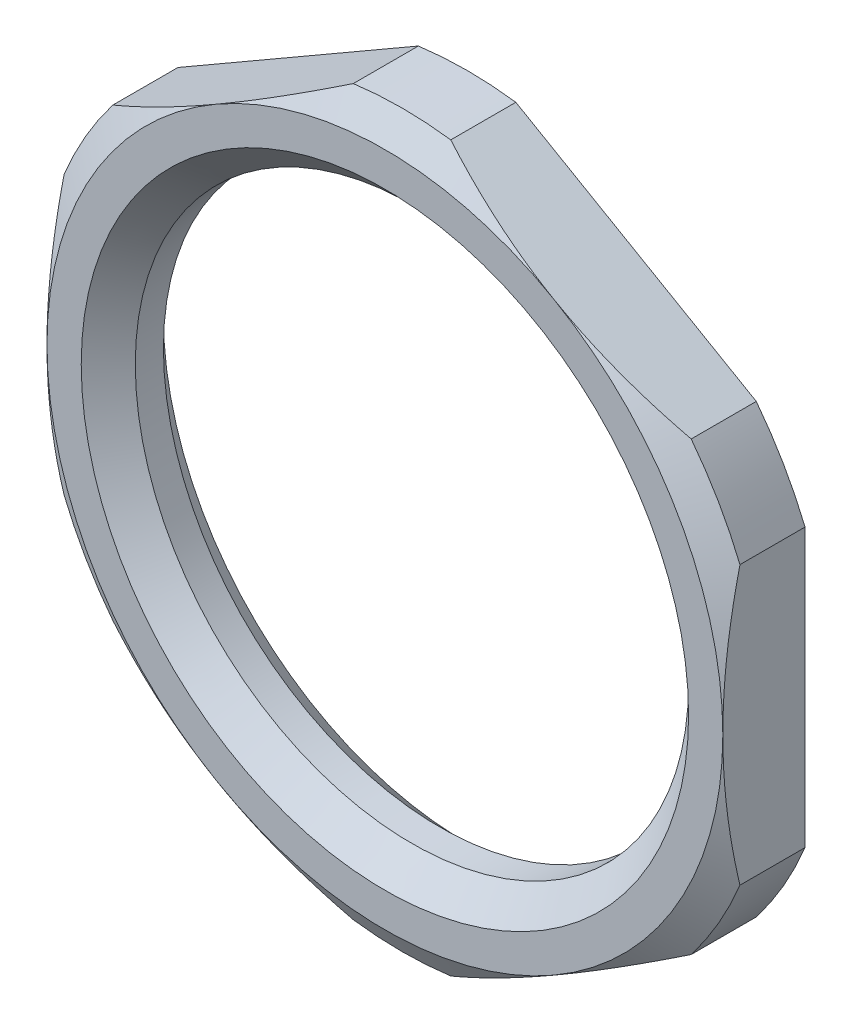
ISO-10303-21;
HEADER;
FILE_DESCRIPTION(('STEP AP214'),'2;1');
FILE_NAME('part.step','',(''),(''),'','','');
FILE_SCHEMA(('AUTOMOTIVE_DESIGN { 1 0 10303 214 1 1 1 1 }'));
ENDSEC;
DATA;
#1=APPLICATION_CONTEXT('core data for automotive mechanical design processes');
#2=APPLICATION_PROTOCOL_DEFINITION('international standard','automotive_design',2000,#1);
#3=PRODUCT_CONTEXT('',#1,'mechanical');
#4=PRODUCT('Part','Part','',(#3));
#5=PRODUCT_RELATED_PRODUCT_CATEGORY('part','',(#4));
#6=PRODUCT_DEFINITION_FORMATION('','',#4);
#7=PRODUCT_DEFINITION_CONTEXT('part definition',#1,'design');
#8=PRODUCT_DEFINITION('design','',#6,#7);
#9=PRODUCT_DEFINITION_SHAPE('','',#8);
#10=(LENGTH_UNIT() NAMED_UNIT(*) SI_UNIT(.MILLI.,.METRE.));
#11=(NAMED_UNIT(*) PLANE_ANGLE_UNIT() SI_UNIT($,.RADIAN.));
#12=(NAMED_UNIT(*) SI_UNIT($,.STERADIAN.) SOLID_ANGLE_UNIT());
#13=UNCERTAINTY_MEASURE_WITH_UNIT(LENGTH_MEASURE(1.E-05),#10,'distance_accuracy_value','');
#14=(GEOMETRIC_REPRESENTATION_CONTEXT(3) GLOBAL_UNCERTAINTY_ASSIGNED_CONTEXT((#13)) GLOBAL_UNIT_ASSIGNED_CONTEXT((#10,
#11,#12)) REPRESENTATION_CONTEXT('',''));
#15=CARTESIAN_POINT('',(0.,0.,0.));
#16=DIRECTION('',(0.,0.,1.));
#17=DIRECTION('',(1.,0.,0.));
#18=AXIS2_PLACEMENT_3D('',#15,#16,#17);
#19=CARTESIAN_POINT('',(0.,16.625,0.));
#20=DIRECTION('',(0.,0.,-1.));
#21=DIRECTION('',(-1.,0.,0.));
#22=AXIS2_PLACEMENT_3D('',#19,#20,#21);
#23=PLANE('',#22);
#24=DIRECTION('',(-0.866025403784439,-0.5,0.));
#25=VECTOR('',#24,1.);
#26=CARTESIAN_POINT('',(-2.05116383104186,20.1777199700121,0.));
#27=LINE('',#26,#25);
#28=CARTESIAN_POINT('',(-2.66877670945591,19.8211410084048,0.));
#29=VERTEX_POINT('',#28);
#30=CARTESIAN_POINT('',(-15.8312232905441,12.2217989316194,0.));
#31=VERTEX_POINT('',#30);
#32=EDGE_CURVE('E389',#29,#31,#27,.T.);
#33=ORIENTED_EDGE('',*,*,#32,.F.);
#34=CARTESIAN_POINT('',(0.,0.,0.));
#35=DIRECTION('',(0.,0.,-1.));
#36=DIRECTION('',(-1.,0.,0.));
#37=AXIS2_PLACEMENT_3D('',#34,#35,#36);
#38=CIRCLE('',#37,20.);
#39=CARTESIAN_POINT('',(2.6687767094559,19.8211410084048,0.));
#40=VERTEX_POINT('',#39);
#41=EDGE_CURVE('E391',#40,#29,#38,.F.);
#42=ORIENTED_EDGE('',*,*,#41,.F.);
#43=DIRECTION('',(-0.866025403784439,0.5,0.));
#44=VECTOR('',#43,1.);
#45=CARTESIAN_POINT('',(2.05116383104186,20.1777199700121,0.));
#46=LINE('',#45,#44);
#47=CARTESIAN_POINT('',(15.8312232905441,12.2217989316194,0.));
#48=VERTEX_POINT('',#47);
#49=EDGE_CURVE('E147',#48,#40,#46,.T.);
#50=ORIENTED_EDGE('',*,*,#49,.F.);
#51=CARTESIAN_POINT('',(2.18575157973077E-13,1.31838984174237E-13,0.));
#52=DIRECTION('',(0.,0.,-1.));
#53=DIRECTION('',(-1.,0.,0.));
#54=AXIS2_PLACEMENT_3D('',#51,#52,#53);
#55=CIRCLE('',#54,19.9999999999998);
#56=CARTESIAN_POINT('',(18.5,7.59934207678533,0.));
#57=VERTEX_POINT('',#56);
#58=EDGE_CURVE('E140',#57,#48,#55,.F.);
#59=ORIENTED_EDGE('',*,*,#58,.F.);
#60=DIRECTION('',(0.,1.,0.));
#61=VECTOR('',#60,1.);
#62=CARTESIAN_POINT('',(18.5,16.625,0.));
#63=LINE('',#62,#61);
#64=CARTESIAN_POINT('',(18.5,-7.59934207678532,0.));
#65=VERTEX_POINT('',#64);
#66=EDGE_CURVE('E130',#65,#57,#63,.T.);
#67=ORIENTED_EDGE('',*,*,#66,.F.);
#68=CARTESIAN_POINT('',(1.49186218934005E-13,0.,0.));
#69=DIRECTION('',(0.,0.,-1.));
#70=DIRECTION('',(-1.,0.,0.));
#71=AXIS2_PLACEMENT_3D('',#68,#69,#70);
#72=CIRCLE('',#71,20.);
#73=CARTESIAN_POINT('',(15.8312232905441,-12.2217989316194,0.));
#74=VERTEX_POINT('',#73);
#75=EDGE_CURVE('E119',#74,#65,#72,.F.);
#76=ORIENTED_EDGE('',*,*,#75,.F.);
#77=DIRECTION('',(0.866025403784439,0.5,0.));
#78=VECTOR('',#77,1.);
#79=CARTESIAN_POINT('',(16.4488361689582,-11.8652199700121,0.));
#80=LINE('',#79,#78);
#81=CARTESIAN_POINT('',(2.66877670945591,-19.8211410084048,0.));
#82=VERTEX_POINT('',#81);
#83=EDGE_CURVE('E124',#82,#74,#80,.T.);
#84=ORIENTED_EDGE('',*,*,#83,.F.);
#85=CARTESIAN_POINT('',(0.,0.,0.));
#86=DIRECTION('',(0.,0.,-1.));
#87=DIRECTION('',(-1.,0.,0.));
#88=AXIS2_PLACEMENT_3D('',#85,#86,#87);
#89=CIRCLE('',#88,20.);
#90=CARTESIAN_POINT('',(-2.6687767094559,-19.8211410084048,0.));
#91=VERTEX_POINT('',#90);
#92=EDGE_CURVE('E379',#91,#82,#89,.F.);
#93=ORIENTED_EDGE('',*,*,#92,.F.);
#94=DIRECTION('',(0.866025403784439,-0.5,0.));
#95=VECTOR('',#94,1.);
#96=CARTESIAN_POINT('',(-16.4488361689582,-11.8652199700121,0.));
#97=LINE('',#96,#95);
#98=CARTESIAN_POINT('',(-15.8312232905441,-12.2217989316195,0.));
#99=VERTEX_POINT('',#98);
#100=EDGE_CURVE('E381',#99,#91,#97,.T.);
#101=ORIENTED_EDGE('',*,*,#100,.F.);
#102=CARTESIAN_POINT('',(-1.56125112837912E-13,0.,0.));
#103=DIRECTION('',(0.,0.,-1.));
#104=DIRECTION('',(-1.,0.,0.));
#105=AXIS2_PLACEMENT_3D('',#102,#103,#104);
#106=CIRCLE('',#105,20.);
#107=CARTESIAN_POINT('',(-18.5,-7.59934207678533,0.));
#108=VERTEX_POINT('',#107);
#109=EDGE_CURVE('E383',#108,#99,#106,.F.);
#110=ORIENTED_EDGE('',*,*,#109,.F.);
#111=DIRECTION('',(0.,-1.,0.));
#112=VECTOR('',#111,1.);
#113=CARTESIAN_POINT('',(-18.5,16.625,0.));
#114=LINE('',#113,#112);
#115=CARTESIAN_POINT('',(-18.5,7.59934207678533,0.));
#116=VERTEX_POINT('',#115);
#117=EDGE_CURVE('E385',#116,#108,#114,.T.);
#118=ORIENTED_EDGE('',*,*,#117,.F.);
#119=CARTESIAN_POINT('',(-1.49186218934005E-13,0.,0.));
#120=DIRECTION('',(0.,0.,-1.));
#121=DIRECTION('',(-1.,0.,0.));
#122=AXIS2_PLACEMENT_3D('',#119,#120,#121);
#123=CIRCLE('',#122,20.);
#124=EDGE_CURVE('E387',#31,#116,#123,.F.);
#125=ORIENTED_EDGE('',*,*,#124,.F.);
#126=EDGE_LOOP('',(#33,#42,#50,#59,#67,#76,#84,#93,#101,#110,#118,#125));
#127=FACE_BOUND('',#126,.T.);
#128=CARTESIAN_POINT('',(0.,0.,0.));
#129=DIRECTION('',(0.,0.,-1.));
#130=DIRECTION('',(-1.,0.,0.));
#131=AXIS2_PLACEMENT_3D('',#128,#129,#130);
#132=CIRCLE('',#131,16.625);
#133=CARTESIAN_POINT('',(-16.625,0.,0.));
#134=VERTEX_POINT('',#133);
#135=EDGE_CURVE('E152',#134,#134,#132,.T.);
#136=ORIENTED_EDGE('',*,*,#135,.F.);
#137=EDGE_LOOP('',(#136));
#138=FACE_BOUND('',#137,.T.);
#139=ADVANCED_FACE('F14',(#127,#138),#23,.T.);
#140=CARTESIAN_POINT('',(0.,0.,0.));
#141=DIRECTION('',(0.,0.,-1.));
#142=DIRECTION('',(-1.,0.,0.));
#143=AXIS2_PLACEMENT_3D('',#140,#141,#142);
#144=CONICAL_SURFACE('',#143,25.7015053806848,1.01229096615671);
#145=CARTESIAN_POINT('',(0.,0.,3.56269597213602));
#146=DIRECTION('',(0.,0.,-1.));
#147=DIRECTION('',(-1.,0.,0.));
#148=AXIS2_PLACEMENT_3D('',#145,#146,#147);
#149=CIRCLE('',#148,20.);
#150=CARTESIAN_POINT('',(-2.6687767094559,19.8211410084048,3.56269597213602));
#151=VERTEX_POINT('',#150);
#152=CARTESIAN_POINT('',(2.66877670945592,19.8211410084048,3.56269597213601));
#153=VERTEX_POINT('',#152);
#154=EDGE_CURVE('E18',#151,#153,#149,.T.);
#155=ORIENTED_EDGE('',*,*,#154,.F.);
#156=CARTESIAN_POINT('',(-15.8314232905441,12.2216834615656,3.5626411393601));
#157=CARTESIAN_POINT('',(-15.4405692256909,12.4473431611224,3.66982372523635));
#158=CARTESIAN_POINT('',(-15.0480636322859,12.6739563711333,3.76924841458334));
#159=CARTESIAN_POINT('',(-14.2599626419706,13.1289666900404,3.95097963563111));
#160=CARTESIAN_POINT('',(-13.8643662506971,13.3573643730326,4.03328040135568));
#161=CARTESIAN_POINT('',(-13.0702309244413,13.8158586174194,4.17914762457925));
#162=CARTESIAN_POINT('',(-12.6716898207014,14.0459564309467,4.24269848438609));
#163=CARTESIAN_POINT('',(-11.8726135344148,14.5073033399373,4.34956833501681));
#164=CARTESIAN_POINT('',(-11.4720785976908,14.7385522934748,4.39288976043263));
#165=CARTESIAN_POINT('',(-10.6779055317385,15.1970683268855,4.45759892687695));
#166=CARTESIAN_POINT('',(-10.2842938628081,15.4243201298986,4.47941708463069));
#167=CARTESIAN_POINT('',(-9.49659374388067,15.8790990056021,4.50211810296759));
#168=CARTESIAN_POINT('',(-9.10250527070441,16.106626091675,4.50299990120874));
#169=CARTESIAN_POINT('',(-8.31502252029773,16.5612794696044,4.48381128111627));
#170=CARTESIAN_POINT('',(-7.92162794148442,16.78840593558,4.46375717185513));
#171=CARTESIAN_POINT('',(-7.13606426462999,17.2419513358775,4.4032133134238));
#172=CARTESIAN_POINT('',(-6.74389504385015,17.4683703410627,4.36272568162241));
#173=CARTESIAN_POINT('',(-6.0439154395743,17.8725037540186,4.27285192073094));
#174=CARTESIAN_POINT('',(-5.73574501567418,18.0504260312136,4.22713948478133));
#175=CARTESIAN_POINT('',(-5.12087682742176,18.4054203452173,4.1242007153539));
#176=CARTESIAN_POINT('',(-4.81417894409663,18.5824924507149,4.06697532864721));
#177=CARTESIAN_POINT('',(-4.19989087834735,18.9371518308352,3.94119033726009));
#178=CARTESIAN_POINT('',(-3.89231473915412,19.1147309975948,3.87253981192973));
#179=CARTESIAN_POINT('',(-3.27902199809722,19.468815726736,3.72504149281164));
#180=CARTESIAN_POINT('',(-2.97330526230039,19.6453213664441,3.64619444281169));
#181=CARTESIAN_POINT('',(-2.6685767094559,19.8212564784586,3.56264113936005));
#182=B_SPLINE_CURVE_WITH_KNOTS('',3,(#156,#157,#158,#159,#160,#161,#162,#163,#164,#165,#166,
#167,#168,#169,#170,#171,#172,#173,#174,#175,#176,#177,#178,#179,#180,#181),.UNSPECIFIED.,.F.,
.F.,(4,2,2,2,2,2,2,2,2,2,2,2,4),(0.,1.39164147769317,2.78375079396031,4.17701493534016,
5.57011135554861,6.93471964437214,8.29939717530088,9.66301241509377,11.0264863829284,
12.102605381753,13.1786359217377,14.2636792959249,15.3486435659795),.UNSPECIFIED.);
#183=CARTESIAN_POINT('',(-9.25,16.0214699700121,4.5));
#184=VERTEX_POINT('',#183);
#185=EDGE_CURVE('E9',#184,#151,#182,.T.);
#186=ORIENTED_EDGE('',*,*,#185,.F.);
#187=CARTESIAN_POINT('',(0.,0.,4.5));
#188=DIRECTION('',(0.,0.,-1.));
#189=DIRECTION('',(-1.,0.,0.));
#190=AXIS2_PLACEMENT_3D('',#187,#188,#189);
#191=CIRCLE('',#190,18.5);
#192=CARTESIAN_POINT('',(9.25,16.0214699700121,4.5));
#193=VERTEX_POINT('',#192);
#194=EDGE_CURVE('E146',#184,#193,#191,.T.);
#195=ORIENTED_EDGE('',*,*,#194,.T.);
#196=CARTESIAN_POINT('',(2.66857670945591,19.8212564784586,3.56264113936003));
#197=CARTESIAN_POINT('',(3.05943077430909,19.5955967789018,3.66982372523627));
#198=CARTESIAN_POINT('',(3.45193636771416,19.3689835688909,3.76924841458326));
#199=CARTESIAN_POINT('',(4.24003735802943,18.9139732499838,3.95097963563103));
#200=CARTESIAN_POINT('',(4.63563374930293,18.6855755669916,4.0332804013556));
#201=CARTESIAN_POINT('',(5.42976907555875,18.2270813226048,4.17914762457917));
#202=CARTESIAN_POINT('',(5.82831017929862,17.9969835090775,4.24269848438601));
#203=CARTESIAN_POINT('',(6.62738646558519,17.5356366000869,4.34956833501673));
#204=CARTESIAN_POINT('',(7.02792140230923,17.3043876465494,4.39288976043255));
#205=CARTESIAN_POINT('',(7.82209446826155,16.8458716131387,4.45759892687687));
#206=CARTESIAN_POINT('',(8.21570613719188,16.6186198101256,4.4794170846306));
#207=CARTESIAN_POINT('',(9.00340625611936,16.1638409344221,4.5021181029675));
#208=CARTESIAN_POINT('',(9.39749472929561,15.9363138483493,4.50299990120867));
#209=CARTESIAN_POINT('',(10.1849774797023,15.4816604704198,4.48381128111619));
#210=CARTESIAN_POINT('',(10.5783720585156,15.2545340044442,4.46375717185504));
#211=CARTESIAN_POINT('',(11.36393573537,14.8009886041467,4.40321331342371));
#212=CARTESIAN_POINT('',(11.7561049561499,14.5745695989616,4.36272568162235));
#213=CARTESIAN_POINT('',(12.4560845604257,14.1704361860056,4.27285192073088));
#214=CARTESIAN_POINT('',(12.7642549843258,13.9925139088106,4.22713948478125));
#215=CARTESIAN_POINT('',(13.3791231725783,13.637519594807,4.1242007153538));
#216=CARTESIAN_POINT('',(13.6858210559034,13.4604474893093,4.06697532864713));
#217=CARTESIAN_POINT('',(14.3001091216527,13.105788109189,3.94119033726));
#218=CARTESIAN_POINT('',(14.6076852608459,12.9282089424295,3.87253981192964));
#219=CARTESIAN_POINT('',(15.2209780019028,12.5741242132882,3.72504149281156));
#220=CARTESIAN_POINT('',(15.5266947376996,12.3976185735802,3.64619444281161));
#221=CARTESIAN_POINT('',(15.8314232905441,12.2216834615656,3.56264113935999));
#222=B_SPLINE_CURVE_WITH_KNOTS('',3,(#196,#197,#198,#199,#200,#201,#202,#203,#204,#205,#206,
#207,#208,#209,#210,#211,#212,#213,#214,#215,#216,#217,#218,#219,#220,#221),.UNSPECIFIED.,.F.,
.F.,(4,2,2,2,2,2,2,2,2,2,2,2,4),(0.,1.39164147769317,2.7837507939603,4.17701493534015,
5.57011135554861,6.93471964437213,8.29939717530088,9.66301241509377,11.0264863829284,
12.102605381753,13.1786359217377,14.2636792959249,15.3486435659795),.UNSPECIFIED.);
#223=EDGE_CURVE('E252',#153,#193,#222,.T.);
#224=ORIENTED_EDGE('',*,*,#223,.F.);
#225=EDGE_LOOP('',(#155,#186,#195,#224));
#226=FACE_BOUND('',#225,.T.);
#227=ADVANCED_FACE('F199',(#226),#144,.T.);
#228=CARTESIAN_POINT('',(-15.8312232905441,12.2217989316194,3.56269597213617));
#229=VERTEX_POINT('',#228);
#230=EDGE_CURVE('E23',#229,#184,#182,.T.);
#231=ORIENTED_EDGE('',*,*,#230,.F.);
#232=CARTESIAN_POINT('',(0.,0.,3.56269597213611));
#233=DIRECTION('',(0.,0.,-1.));
#234=DIRECTION('',(-1.,0.,0.));
#235=AXIS2_PLACEMENT_3D('',#232,#233,#234);
#236=CIRCLE('',#235,20.);
#237=CARTESIAN_POINT('',(-18.5,7.59934207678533,3.56269597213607));
#238=VERTEX_POINT('',#237);
#239=EDGE_CURVE('E246',#238,#229,#236,.T.);
#240=ORIENTED_EDGE('',*,*,#239,.F.);
#241=CARTESIAN_POINT('',(-18.5,-23.4504095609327,-2.60429183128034));
#242=CARTESIAN_POINT('',(-18.5,-23.1357300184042,-2.44991711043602));
#243=CARTESIAN_POINT('',(-18.5,-22.8205817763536,-2.29649854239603));
#244=CARTESIAN_POINT('',(-18.5,-22.1892685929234,-1.99175793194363));
#245=CARTESIAN_POINT('',(-18.5,-21.8731036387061,-1.84043591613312));
#246=CARTESIAN_POINT('',(-18.5,-20.9228803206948,-1.38985115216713));
#247=CARTESIAN_POINT('',(-18.5,-20.2871892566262,-1.09401679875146));
#248=CARTESIAN_POINT('',(-18.5,-19.0082003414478,-0.512139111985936));
#249=CARTESIAN_POINT('',(-18.5,-18.3648820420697,-0.226140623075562));
#250=CARTESIAN_POINT('',(-18.5,-17.0724681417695,0.332463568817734));
#251=CARTESIAN_POINT('',(-18.5,-16.423372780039,0.605069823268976));
#252=CARTESIAN_POINT('',(-18.5,-15.1033739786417,1.14017434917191));
#253=CARTESIAN_POINT('',(-18.5,-14.4323145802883,1.40228969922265));
#254=CARTESIAN_POINT('',(-18.5,-13.0823275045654,1.90566934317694));
#255=CARTESIAN_POINT('',(-18.5,-12.4033993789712,2.14693244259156));
#256=CARTESIAN_POINT('',(-18.5,-11.0378508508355,2.60358352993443));
#257=CARTESIAN_POINT('',(-18.5,-10.3512419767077,2.81900576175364));
#258=CARTESIAN_POINT('',(-18.5,-8.96903227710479,3.21877370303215));
#259=CARTESIAN_POINT('',(-18.5,-8.27343290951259,3.40312438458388));
#260=CARTESIAN_POINT('',(-18.5,-7.10423360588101,3.67991431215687));
#261=CARTESIAN_POINT('',(-18.5,-6.63305921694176,3.78261674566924));
#262=CARTESIAN_POINT('',(-18.5,-5.68701169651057,3.96937383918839));
#263=CARTESIAN_POINT('',(-18.5,-5.21213866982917,4.05342902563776));
#264=CARTESIAN_POINT('',(-18.5,-4.25929260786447,4.20107924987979));
#265=CARTESIAN_POINT('',(-18.5,-3.78132016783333,4.2646781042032));
#266=CARTESIAN_POINT('',(-18.5,-2.82294483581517,4.36990557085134));
#267=CARTESIAN_POINT('',(-18.5,-2.34254195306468,4.41153426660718));
#268=CARTESIAN_POINT('',(-18.5,-1.38561777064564,4.47139523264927));
#269=CARTESIAN_POINT('',(-18.5,-0.909112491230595,4.48988179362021));
#270=CARTESIAN_POINT('',(-18.5,0.0442306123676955,4.50380264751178));
#271=CARTESIAN_POINT('',(-18.5,0.521068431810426,4.49923726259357));
#272=CARTESIAN_POINT('',(-18.5,1.47401054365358,4.46717642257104));
#273=CARTESIAN_POINT('',(-18.5,1.9501147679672,4.43967895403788));
#274=CARTESIAN_POINT('',(-18.5,2.90051716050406,4.36248745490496));
#275=CARTESIAN_POINT('',(-18.5,3.3748152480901,4.31279244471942));
#276=CARTESIAN_POINT('',(-18.5,4.48935400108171,4.17096823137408));
#277=CARTESIAN_POINT('',(-18.5,5.1284809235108,4.07002738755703));
#278=CARTESIAN_POINT('',(-18.5,6.40031302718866,3.83362466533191));
#279=CARTESIAN_POINT('',(-18.5,7.0330172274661,3.69815759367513));
#280=CARTESIAN_POINT('',(-18.5,8.29176688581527,3.39718832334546));
#281=CARTESIAN_POINT('',(-18.5,8.91780596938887,3.23165970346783));
#282=CARTESIAN_POINT('',(-18.5,10.1625219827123,2.87518007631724));
#283=CARTESIAN_POINT('',(-18.5,10.7811991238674,2.68422980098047));
#284=CARTESIAN_POINT('',(-18.5,12.0182061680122,2.27881765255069));
#285=CARTESIAN_POINT('',(-18.5,12.6364592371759,2.0641228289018));
#286=CARTESIAN_POINT('',(-18.5,13.8663400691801,1.61660325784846));
#287=CARTESIAN_POINT('',(-18.5,14.4779677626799,1.38377832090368));
#288=CARTESIAN_POINT('',(-18.5,15.6949631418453,0.903173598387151));
#289=CARTESIAN_POINT('',(-18.5,16.3003336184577,0.655400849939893));
#290=CARTESIAN_POINT('',(-18.5,17.5057607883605,0.147325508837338));
#291=CARTESIAN_POINT('',(-18.5,18.1058176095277,-0.112976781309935));
#292=CARTESIAN_POINT('',(-18.5,19.1048338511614,-0.556803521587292));
#293=CARTESIAN_POINT('',(-18.5,19.5050780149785,-0.737448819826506));
#294=CARTESIAN_POINT('',(-18.5,20.3036169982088,-1.10294045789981));
#295=CARTESIAN_POINT('',(-18.5,20.701911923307,-1.28778656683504));
#296=CARTESIAN_POINT('',(-18.5,21.4927980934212,-1.6593766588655));
#297=CARTESIAN_POINT('',(-18.5,21.8854067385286,-1.84608366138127));
#298=CARTESIAN_POINT('',(-18.5,22.6690537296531,-2.22280378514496));
#299=CARTESIAN_POINT('',(-18.5,23.0600920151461,-2.41281703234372));
#300=CARTESIAN_POINT('',(-18.5,23.4504095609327,-2.60429183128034));
#301=B_SPLINE_CURVE_WITH_KNOTS('',3,(#241,#242,#243,#244,#245,#246,#247,#248,#249,#250,#251,
#252,#253,#254,#255,#256,#257,#258,#259,#260,#261,#262,#263,#264,#265,#266,#267,#268,#269,#270,
#271,#272,#273,#274,#275,#276,#277,#278,#279,#280,#281,#282,#283,#284,#285,#286,#287,#288,#289,
#290,#291,#292,#293,#294,#295,#296,#297,#298,#299,#300),.UNSPECIFIED.,.F.,.F.,(4,2,2,2,2,2,2,2,
2,2,2,2,2,2,2,2,2,2,2,2,2,2,2,2,2,2,2,2,2,4),(0.,1.05151631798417,2.10304596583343,
4.20642538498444,6.31838185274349,8.43025128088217,10.5912726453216,12.7524177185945,
14.9106664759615,17.0685695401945,18.5149604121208,19.9613104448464,21.4073904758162,
22.8534650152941,24.2835061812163,25.7135273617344,27.1436741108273,28.5738839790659,
30.5139027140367,32.45421342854,34.3962378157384,36.3382063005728,38.3012781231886,
40.2643704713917,42.2265457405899,44.1886736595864,45.5060163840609,46.8232868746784,
48.127498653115,49.4317602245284),.UNSPECIFIED.);
#302=CARTESIAN_POINT('',(-18.5,0.,4.50000000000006));
#303=VERTEX_POINT('',#302);
#304=EDGE_CURVE('E248',#303,#238,#301,.T.);
#305=ORIENTED_EDGE('',*,*,#304,.F.);
#306=EDGE_CURVE('E141',#303,#184,#191,.T.);
#307=ORIENTED_EDGE('',*,*,#306,.T.);
#308=EDGE_LOOP('',(#231,#240,#305,#307));
#309=FACE_BOUND('',#308,.T.);
#310=ADVANCED_FACE('F204',(#309),#144,.T.);
#311=CARTESIAN_POINT('',(15.8312232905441,12.2217989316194,3.56269597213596));
#312=VERTEX_POINT('',#311);
#313=EDGE_CURVE('E256',#193,#312,#222,.T.);
#314=ORIENTED_EDGE('',*,*,#313,.F.);
#315=CARTESIAN_POINT('',(18.5,0.,4.49999999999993));
#316=VERTEX_POINT('',#315);
#317=EDGE_CURVE('E153',#193,#316,#191,.T.);
#318=ORIENTED_EDGE('',*,*,#317,.T.);
#319=CARTESIAN_POINT('',(18.5,23.4504095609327,-2.60429183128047));
#320=CARTESIAN_POINT('',(18.5,23.1357300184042,-2.44991711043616));
#321=CARTESIAN_POINT('',(18.5,22.8205817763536,-2.29649854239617));
#322=CARTESIAN_POINT('',(18.5,22.1892685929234,-1.99175793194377));
#323=CARTESIAN_POINT('',(18.5,21.873103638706,-1.84043591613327));
#324=CARTESIAN_POINT('',(18.5,20.9228803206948,-1.38985115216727));
#325=CARTESIAN_POINT('',(18.5,20.2871892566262,-1.0940167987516));
#326=CARTESIAN_POINT('',(18.5,19.0082003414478,-0.512139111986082));
#327=CARTESIAN_POINT('',(18.5,18.3648820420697,-0.226140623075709));
#328=CARTESIAN_POINT('',(18.5,17.0724681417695,0.332463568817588));
#329=CARTESIAN_POINT('',(18.5,16.423372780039,0.605069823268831));
#330=CARTESIAN_POINT('',(18.5,15.1033739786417,1.14017434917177));
#331=CARTESIAN_POINT('',(18.5,14.4323145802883,1.40228969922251));
#332=CARTESIAN_POINT('',(18.5,13.0823275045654,1.90566934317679));
#333=CARTESIAN_POINT('',(18.5,12.4033993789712,2.14693244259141));
#334=CARTESIAN_POINT('',(18.5,11.0378508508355,2.60358352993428));
#335=CARTESIAN_POINT('',(18.5,10.3512419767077,2.81900576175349));
#336=CARTESIAN_POINT('',(18.5,8.96903227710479,3.21877370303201));
#337=CARTESIAN_POINT('',(18.5,8.2734329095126,3.40312438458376));
#338=CARTESIAN_POINT('',(18.5,7.10423360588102,3.67991431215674));
#339=CARTESIAN_POINT('',(18.5,6.63305921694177,3.78261674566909));
#340=CARTESIAN_POINT('',(18.5,5.68701169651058,3.96937383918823));
#341=CARTESIAN_POINT('',(18.5,5.21213866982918,4.0534290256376));
#342=CARTESIAN_POINT('',(18.5,4.25929260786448,4.20107924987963));
#343=CARTESIAN_POINT('',(18.5,3.78132016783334,4.26467810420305));
#344=CARTESIAN_POINT('',(18.5,2.82294483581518,4.36990557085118));
#345=CARTESIAN_POINT('',(18.5,2.34254195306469,4.41153426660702));
#346=CARTESIAN_POINT('',(18.5,1.38561777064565,4.47139523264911));
#347=CARTESIAN_POINT('',(18.5,0.909112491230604,4.48988179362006));
#348=CARTESIAN_POINT('',(18.5,-0.0442306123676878,4.50380264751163));
#349=CARTESIAN_POINT('',(18.5,-0.52106843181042,4.49923726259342));
#350=CARTESIAN_POINT('',(18.5,-1.47401054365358,4.46717642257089));
#351=CARTESIAN_POINT('',(18.5,-1.95011476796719,4.43967895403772));
#352=CARTESIAN_POINT('',(18.5,-2.90051716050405,4.36248745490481));
#353=CARTESIAN_POINT('',(18.5,-3.3748152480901,4.31279244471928));
#354=CARTESIAN_POINT('',(18.5,-4.4893540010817,4.17096823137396));
#355=CARTESIAN_POINT('',(18.5,-5.12848092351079,4.07002738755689));
#356=CARTESIAN_POINT('',(18.5,-6.40031302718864,3.83362466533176));
#357=CARTESIAN_POINT('',(18.5,-7.03301722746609,3.69815759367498));
#358=CARTESIAN_POINT('',(18.5,-8.29176688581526,3.39718832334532));
#359=CARTESIAN_POINT('',(18.5,-8.91780596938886,3.23165970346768));
#360=CARTESIAN_POINT('',(18.5,-10.1625219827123,2.87518007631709));
#361=CARTESIAN_POINT('',(18.5,-10.7811991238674,2.68422980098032));
#362=CARTESIAN_POINT('',(18.5,-12.0182061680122,2.27881765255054));
#363=CARTESIAN_POINT('',(18.5,-12.6364592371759,2.06412282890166));
#364=CARTESIAN_POINT('',(18.5,-13.8663400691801,1.61660325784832));
#365=CARTESIAN_POINT('',(18.5,-14.4779677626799,1.38377832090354));
#366=CARTESIAN_POINT('',(18.5,-15.6949631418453,0.903173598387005));
#367=CARTESIAN_POINT('',(18.5,-16.3003336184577,0.655400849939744));
#368=CARTESIAN_POINT('',(18.5,-17.5057607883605,0.147325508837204));
#369=CARTESIAN_POINT('',(18.5,-18.1058176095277,-0.112976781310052));
#370=CARTESIAN_POINT('',(18.5,-19.1048338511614,-0.556803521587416));
#371=CARTESIAN_POINT('',(18.5,-19.5050780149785,-0.737448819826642));
#372=CARTESIAN_POINT('',(18.5,-20.3036169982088,-1.10294045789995));
#373=CARTESIAN_POINT('',(18.5,-20.7019119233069,-1.28778656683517));
#374=CARTESIAN_POINT('',(18.5,-21.4927980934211,-1.65937665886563));
#375=CARTESIAN_POINT('',(18.5,-21.8854067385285,-1.84608366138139));
#376=CARTESIAN_POINT('',(18.5,-22.669053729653,-2.22280378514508));
#377=CARTESIAN_POINT('',(18.5,-23.060092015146,-2.41281703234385));
#378=CARTESIAN_POINT('',(18.5,-23.4504095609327,-2.60429183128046));
#379=B_SPLINE_CURVE_WITH_KNOTS('',3,(#319,#320,#321,#322,#323,#324,#325,#326,#327,#328,#329,
#330,#331,#332,#333,#334,#335,#336,#337,#338,#339,#340,#341,#342,#343,#344,#345,#346,#347,#348,
#349,#350,#351,#352,#353,#354,#355,#356,#357,#358,#359,#360,#361,#362,#363,#364,#365,#366,#367,
#368,#369,#370,#371,#372,#373,#374,#375,#376,#377,#378),.UNSPECIFIED.,.F.,.F.,(4,2,2,2,2,2,2,2,
2,2,2,2,2,2,2,2,2,2,2,2,2,2,2,2,2,2,2,2,2,4),(0.,1.05151631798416,2.10304596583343,
4.20642538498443,6.31838185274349,8.43025128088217,10.5912726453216,12.7524177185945,
14.9106664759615,17.0685695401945,18.5149604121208,19.9613104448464,21.4073904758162,
22.853465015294,24.2835061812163,25.7135273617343,27.1436741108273,28.5738839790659,
30.5139027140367,32.45421342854,34.3962378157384,36.3382063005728,38.3012781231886,
40.2643704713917,42.2265457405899,44.1886736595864,45.5060163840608,46.8232868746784,
48.127498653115,49.4317602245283),.UNSPECIFIED.);
#380=CARTESIAN_POINT('',(18.5,7.59934207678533,3.5626959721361));
#381=VERTEX_POINT('',#380);
#382=EDGE_CURVE('E354',#381,#316,#379,.T.);
#383=ORIENTED_EDGE('',*,*,#382,.F.);
#384=CARTESIAN_POINT('',(0.,0.,3.56269597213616));
#385=DIRECTION('',(0.,0.,-1.));
#386=DIRECTION('',(-1.,0.,0.));
#387=AXIS2_PLACEMENT_3D('',#384,#385,#386);
#388=CIRCLE('',#387,19.9999999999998);
#389=EDGE_CURVE('E272',#312,#381,#388,.T.);
#390=ORIENTED_EDGE('',*,*,#389,.F.);
#391=EDGE_LOOP('',(#314,#318,#383,#390));
#392=FACE_BOUND('',#391,.T.);
#393=ADVANCED_FACE('F334',(#392),#144,.T.);
#394=CARTESIAN_POINT('',(-18.5,-7.59934207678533,3.56269597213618));
#395=VERTEX_POINT('',#394);
#396=EDGE_CURVE('E254',#395,#303,#301,.T.);
#397=ORIENTED_EDGE('',*,*,#396,.F.);
#398=CARTESIAN_POINT('',(0.,0.,3.56269597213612));
#399=DIRECTION('',(0.,0.,-1.));
#400=DIRECTION('',(-1.,0.,0.));
#401=AXIS2_PLACEMENT_3D('',#398,#399,#400);
#402=CIRCLE('',#401,20.);
#403=CARTESIAN_POINT('',(-15.8312232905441,-12.2217989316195,3.56269597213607));
#404=VERTEX_POINT('',#403);
#405=EDGE_CURVE('E264',#404,#395,#402,.T.);
#406=ORIENTED_EDGE('',*,*,#405,.F.);
#407=CARTESIAN_POINT('',(-2.66857670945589,-19.8212564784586,3.56264113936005));
#408=CARTESIAN_POINT('',(-3.05943077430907,-19.5955967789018,3.6698237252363));
#409=CARTESIAN_POINT('',(-3.45193636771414,-19.3689835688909,3.76924841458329));
#410=CARTESIAN_POINT('',(-4.2400373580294,-18.9139732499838,3.95097963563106));
#411=CARTESIAN_POINT('',(-4.63563374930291,-18.6855755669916,4.03328040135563));
#412=CARTESIAN_POINT('',(-5.42976907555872,-18.2270813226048,4.17914762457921));
#413=CARTESIAN_POINT('',(-5.8283101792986,-17.9969835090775,4.24269848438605));
#414=CARTESIAN_POINT('',(-6.62738646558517,-17.5356366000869,4.34956833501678));
#415=CARTESIAN_POINT('',(-7.0279214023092,-17.3043876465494,4.3928897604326));
#416=CARTESIAN_POINT('',(-7.82209446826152,-16.8458716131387,4.45759892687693));
#417=CARTESIAN_POINT('',(-8.21570613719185,-16.6186198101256,4.47941708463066));
#418=CARTESIAN_POINT('',(-9.00340625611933,-16.1638409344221,4.50211810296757));
#419=CARTESIAN_POINT('',(-9.39749472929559,-15.9363138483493,4.50299990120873));
#420=CARTESIAN_POINT('',(-10.1849774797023,-15.4816604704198,4.48381128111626));
#421=CARTESIAN_POINT('',(-10.5783720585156,-15.2545340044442,4.46375717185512));
#422=CARTESIAN_POINT('',(-11.36393573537,-14.8009886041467,4.4032133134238));
#423=CARTESIAN_POINT('',(-11.7561049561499,-14.5745695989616,4.36272568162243));
#424=CARTESIAN_POINT('',(-12.4560845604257,-14.1704361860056,4.27285192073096));
#425=CARTESIAN_POINT('',(-12.7642549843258,-13.9925139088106,4.22713948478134));
#426=CARTESIAN_POINT('',(-13.3791231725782,-13.637519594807,4.1242007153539));
#427=CARTESIAN_POINT('',(-13.6858210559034,-13.4604474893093,4.06697532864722));
#428=CARTESIAN_POINT('',(-14.3001091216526,-13.105788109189,3.9411903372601));
#429=CARTESIAN_POINT('',(-14.6076852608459,-12.9282089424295,3.87253981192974));
#430=CARTESIAN_POINT('',(-15.2209780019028,-12.5741242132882,3.72504149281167));
#431=CARTESIAN_POINT('',(-15.5266947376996,-12.3976185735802,3.64619444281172));
#432=CARTESIAN_POINT('',(-15.8314232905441,-12.2216834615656,3.5626411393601));
#433=B_SPLINE_CURVE_WITH_KNOTS('',3,(#407,#408,#409,#410,#411,#412,#413,#414,#415,#416,#417,
#418,#419,#420,#421,#422,#423,#424,#425,#426,#427,#428,#429,#430,#431,#432),.UNSPECIFIED.,.F.,
.F.,(4,2,2,2,2,2,2,2,2,2,2,2,4),(0.,1.39164147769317,2.78375079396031,4.17701493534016,
5.57011135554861,6.93471964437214,8.29939717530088,9.66301241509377,11.0264863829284,
12.102605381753,13.1786359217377,14.2636792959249,15.3486435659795),.UNSPECIFIED.);
#434=CARTESIAN_POINT('',(-9.25,-16.0214699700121,4.5));
#435=VERTEX_POINT('',#434);
#436=EDGE_CURVE('E267',#435,#404,#433,.T.);
#437=ORIENTED_EDGE('',*,*,#436,.F.);
#438=EDGE_CURVE('E144',#435,#303,#191,.T.);
#439=ORIENTED_EDGE('',*,*,#438,.T.);
#440=EDGE_LOOP('',(#397,#406,#437,#439));
#441=FACE_BOUND('',#440,.T.);
#442=ADVANCED_FACE('F328',(#441),#144,.T.);
#443=CARTESIAN_POINT('',(-2.66877670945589,-19.8211410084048,3.56269597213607));
#444=VERTEX_POINT('',#443);
#445=EDGE_CURVE('E274',#444,#435,#433,.T.);
#446=ORIENTED_EDGE('',*,*,#445,.F.);
#447=CARTESIAN_POINT('',(0.,0.,3.56269597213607));
#448=DIRECTION('',(0.,0.,-1.));
#449=DIRECTION('',(-1.,0.,0.));
#450=AXIS2_PLACEMENT_3D('',#447,#448,#449);
#451=CIRCLE('',#450,20.);
#452=CARTESIAN_POINT('',(2.66877670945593,-19.8211410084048,3.562695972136));
#453=VERTEX_POINT('',#452);
#454=EDGE_CURVE('E280',#453,#444,#451,.T.);
#455=ORIENTED_EDGE('',*,*,#454,.F.);
#456=CARTESIAN_POINT('',(15.8314232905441,-12.2216834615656,3.56264113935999));
#457=CARTESIAN_POINT('',(15.4405692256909,-12.4473431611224,3.66982372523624));
#458=CARTESIAN_POINT('',(15.0480636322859,-12.6739563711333,3.76924841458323));
#459=CARTESIAN_POINT('',(14.2599626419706,-13.1289666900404,3.950979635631));
#460=CARTESIAN_POINT('',(13.8643662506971,-13.3573643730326,4.03328040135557));
#461=CARTESIAN_POINT('',(13.0702309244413,-13.8158586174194,4.17914762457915));
#462=CARTESIAN_POINT('',(12.6716898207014,-14.0459564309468,4.24269848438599));
#463=CARTESIAN_POINT('',(11.8726135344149,-14.5073033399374,4.34956833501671));
#464=CARTESIAN_POINT('',(11.4720785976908,-14.7385522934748,4.39288976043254));
#465=CARTESIAN_POINT('',(10.6779055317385,-15.1970683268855,4.45759892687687));
#466=CARTESIAN_POINT('',(10.2842938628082,-15.4243201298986,4.47941708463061));
#467=CARTESIAN_POINT('',(9.4965937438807,-15.8790990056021,4.50211810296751));
#468=CARTESIAN_POINT('',(9.10250527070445,-16.106626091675,4.50299990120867));
#469=CARTESIAN_POINT('',(8.31502252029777,-16.5612794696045,4.4838112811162));
#470=CARTESIAN_POINT('',(7.92162794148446,-16.7884059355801,4.46375717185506));
#471=CARTESIAN_POINT('',(7.13606426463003,-17.2419513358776,4.40321331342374));
#472=CARTESIAN_POINT('',(6.74389504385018,-17.4683703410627,4.36272568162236));
#473=CARTESIAN_POINT('',(6.04391543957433,-17.8725037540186,4.2728519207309));
#474=CARTESIAN_POINT('',(5.73574501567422,-18.0504260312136,4.22713948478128));
#475=CARTESIAN_POINT('',(5.1208768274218,-18.4054203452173,4.12420071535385));
#476=CARTESIAN_POINT('',(4.81417894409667,-18.5824924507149,4.06697532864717));
#477=CARTESIAN_POINT('',(4.19989087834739,-18.9371518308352,3.94119033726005));
#478=CARTESIAN_POINT('',(3.89231473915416,-19.1147309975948,3.87253981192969));
#479=CARTESIAN_POINT('',(3.27902199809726,-19.468815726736,3.72504149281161));
#480=CARTESIAN_POINT('',(2.97330526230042,-19.6453213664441,3.64619444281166));
#481=CARTESIAN_POINT('',(2.66857670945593,-19.8212564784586,3.56264113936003));
#482=B_SPLINE_CURVE_WITH_KNOTS('',3,(#456,#457,#458,#459,#460,#461,#462,#463,#464,#465,#466,
#467,#468,#469,#470,#471,#472,#473,#474,#475,#476,#477,#478,#479,#480,#481),.UNSPECIFIED.,.F.,
.F.,(4,2,2,2,2,2,2,2,2,2,2,2,4),(0.,1.39164147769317,2.7837507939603,4.17701493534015,
5.5701113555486,6.93471964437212,8.29939717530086,9.66301241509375,11.0264863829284,
12.102605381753,13.1786359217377,14.2636792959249,15.3486435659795),.UNSPECIFIED.);
#483=CARTESIAN_POINT('',(9.25,-16.0214699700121,4.5));
#484=VERTEX_POINT('',#483);
#485=EDGE_CURVE('E175',#484,#453,#482,.T.);
#486=ORIENTED_EDGE('',*,*,#485,.F.);
#487=EDGE_CURVE('E341',#484,#435,#191,.T.);
#488=ORIENTED_EDGE('',*,*,#487,.T.);
#489=EDGE_LOOP('',(#446,#455,#486,#488));
#490=FACE_BOUND('',#489,.T.);
#491=ADVANCED_FACE('F221',(#490),#144,.T.);
#492=CARTESIAN_POINT('',(0.,18.5,4.5));
#493=DIRECTION('',(0.,0.,1.));
#494=DIRECTION('',(1.,0.,0.));
#495=AXIS2_PLACEMENT_3D('',#492,#493,#494);
#496=PLANE('',#495);
#497=CARTESIAN_POINT('',(0.,0.,4.5));
#498=DIRECTION('',(0.,0.,-1.));
#499=DIRECTION('',(-1.,0.,0.));
#500=AXIS2_PLACEMENT_3D('',#497,#498,#499);
#501=CIRCLE('',#500,16.625);
#502=CARTESIAN_POINT('',(-16.625,0.,4.50000000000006));
#503=VERTEX_POINT('',#502);
#504=EDGE_CURVE('E162',#503,#503,#501,.T.);
#505=ORIENTED_EDGE('',*,*,#504,.T.);
#506=EDGE_LOOP('',(#505));
#507=FACE_BOUND('',#506,.T.);
#508=ORIENTED_EDGE('',*,*,#194,.F.);
#509=ORIENTED_EDGE('',*,*,#306,.F.);
#510=ORIENTED_EDGE('',*,*,#438,.F.);
#511=ORIENTED_EDGE('',*,*,#487,.F.);
#512=EDGE_CURVE('E348',#316,#484,#191,.T.);
#513=ORIENTED_EDGE('',*,*,#512,.F.);
#514=ORIENTED_EDGE('',*,*,#317,.F.);
#515=EDGE_LOOP('',(#508,#509,#510,#511,#513,#514));
#516=FACE_BOUND('',#515,.T.);
#517=ADVANCED_FACE('F16',(#507,#516),#496,.T.);
#518=CARTESIAN_POINT('',(0.,0.,4.5));
#519=DIRECTION('',(0.,0.,1.));
#520=DIRECTION('',(1.,0.,0.));
#521=AXIS2_PLACEMENT_3D('',#518,#519,#520);
#522=CONICAL_SURFACE('',#521,16.625,0.785398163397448);
#523=CARTESIAN_POINT('',(0.,0.,3.0205));
#524=DIRECTION('',(0.,0.,-1.));
#525=DIRECTION('',(-1.,0.,0.));
#526=AXIS2_PLACEMENT_3D('',#523,#524,#525);
#527=CIRCLE('',#526,15.1455);
#528=CARTESIAN_POINT('',(-15.1455,0.,3.02050000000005));
#529=VERTEX_POINT('',#528);
#530=EDGE_CURVE('E159',#529,#529,#527,.T.);
#531=ORIENTED_EDGE('',*,*,#530,.T.);
#532=EDGE_LOOP('',(#531));
#533=FACE_BOUND('',#532,.T.);
#534=ORIENTED_EDGE('',*,*,#504,.F.);
#535=EDGE_LOOP('',(#534));
#536=FACE_BOUND('',#535,.T.);
#537=ADVANCED_FACE('F213',(#533,#536),#522,.F.);
#538=CARTESIAN_POINT('',(0.,0.,0.));
#539=DIRECTION('',(0.,0.,-1.));
#540=DIRECTION('',(-1.,0.,0.));
#541=AXIS2_PLACEMENT_3D('',#538,#539,#540);
#542=CYLINDRICAL_SURFACE('',#541,15.1455);
#543=CARTESIAN_POINT('',(0.,0.,1.4795));
#544=DIRECTION('',(0.,0.,-1.));
#545=DIRECTION('',(-1.,0.,0.));
#546=AXIS2_PLACEMENT_3D('',#543,#544,#545);
#547=CIRCLE('',#546,15.1455);
#548=CARTESIAN_POINT('',(-15.1455,0.,1.47950000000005));
#549=VERTEX_POINT('',#548);
#550=EDGE_CURVE('E156',#549,#549,#547,.T.);
#551=ORIENTED_EDGE('',*,*,#550,.T.);
#552=EDGE_LOOP('',(#551));
#553=FACE_BOUND('',#552,.T.);
#554=ORIENTED_EDGE('',*,*,#530,.F.);
#555=EDGE_LOOP('',(#554));
#556=FACE_BOUND('',#555,.T.);
#557=ADVANCED_FACE('F210',(#553,#556),#542,.F.);
#558=CARTESIAN_POINT('',(0.,0.,1.4795));
#559=DIRECTION('',(0.,0.,-1.));
#560=DIRECTION('',(-1.,0.,0.));
#561=AXIS2_PLACEMENT_3D('',#558,#559,#560);
#562=CONICAL_SURFACE('',#561,15.1455,0.785398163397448);
#563=ORIENTED_EDGE('',*,*,#135,.T.);
#564=EDGE_LOOP('',(#563));
#565=FACE_BOUND('',#564,.T.);
#566=ORIENTED_EDGE('',*,*,#550,.F.);
#567=EDGE_LOOP('',(#566));
#568=FACE_BOUND('',#567,.T.);
#569=ADVANCED_FACE('F207',(#565,#568),#562,.F.);
#570=CARTESIAN_POINT('',(18.5,-7.59934207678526,3.56269597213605));
#571=VERTEX_POINT('',#570);
#572=EDGE_CURVE('E133',#316,#571,#379,.T.);
#573=ORIENTED_EDGE('',*,*,#572,.F.);
#574=ORIENTED_EDGE('',*,*,#512,.T.);
#575=CARTESIAN_POINT('',(15.8312232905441,-12.2217989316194,3.56269597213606));
#576=VERTEX_POINT('',#575);
#577=EDGE_CURVE('E167',#576,#484,#482,.T.);
#578=ORIENTED_EDGE('',*,*,#577,.F.);
#579=CARTESIAN_POINT('',(0.,0.,3.56269597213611));
#580=DIRECTION('',(0.,0.,-1.));
#581=DIRECTION('',(-1.,0.,0.));
#582=AXIS2_PLACEMENT_3D('',#579,#580,#581);
#583=CIRCLE('',#582,20.);
#584=EDGE_CURVE('E165',#571,#576,#583,.T.);
#585=ORIENTED_EDGE('',*,*,#584,.F.);
#586=EDGE_LOOP('',(#573,#574,#578,#585));
#587=FACE_BOUND('',#586,.T.);
#588=ADVANCED_FACE('F182',(#587),#144,.T.);
#589=CARTESIAN_POINT('',(18.5,7.59934207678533,-5.5));
#590=DIRECTION('',(-1.,0.,0.));
#591=DIRECTION('',(0.,0.,1.));
#592=AXIS2_PLACEMENT_3D('',#589,#590,#591);
#593=PLANE('',#592);
#594=ORIENTED_EDGE('',*,*,#66,.T.);
#595=DIRECTION('',(0.,0.,1.));
#596=VECTOR('',#595,1.);
#597=CARTESIAN_POINT('',(18.5,7.59934207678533,-5.5));
#598=LINE('',#597,#596);
#599=EDGE_CURVE('E125',#57,#381,#598,.T.);
#600=ORIENTED_EDGE('',*,*,#599,.T.);
#601=ORIENTED_EDGE('',*,*,#382,.T.);
#602=ORIENTED_EDGE('',*,*,#572,.T.);
#603=DIRECTION('',(0.,0.,1.));
#604=VECTOR('',#603,1.);
#605=CARTESIAN_POINT('',(18.5,-7.59934207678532,-5.5));
#606=LINE('',#605,#604);
#607=EDGE_CURVE('E35',#65,#571,#606,.T.);
#608=ORIENTED_EDGE('',*,*,#607,.F.);
#609=EDGE_LOOP('',(#594,#600,#601,#602,#608));
#610=FACE_BOUND('',#609,.T.);
#611=ADVANCED_FACE('F128',(#610),#593,.F.);
#612=CARTESIAN_POINT('',(1.9937201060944E-13,1.31838984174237E-13,-5.5));
#613=DIRECTION('',(0.,0.,1.));
#614=DIRECTION('',(1.,0.,0.));
#615=AXIS2_PLACEMENT_3D('',#612,#613,#614);
#616=CYLINDRICAL_SURFACE('',#615,19.9999999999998);
#617=ORIENTED_EDGE('',*,*,#58,.T.);
#618=DIRECTION('',(0.,0.,1.));
#619=VECTOR('',#618,1.);
#620=CARTESIAN_POINT('',(15.8312232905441,12.2217989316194,-5.5));
#621=LINE('',#620,#619);
#622=EDGE_CURVE('E357',#48,#312,#621,.T.);
#623=ORIENTED_EDGE('',*,*,#622,.T.);
#624=ORIENTED_EDGE('',*,*,#389,.T.);
#625=ORIENTED_EDGE('',*,*,#599,.F.);
#626=EDGE_LOOP('',(#617,#623,#624,#625));
#627=FACE_BOUND('',#626,.T.);
#628=ADVANCED_FACE('F313',(#627),#616,.T.);
#629=CARTESIAN_POINT('',(2.66877670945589,19.8211410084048,-5.5));
#630=DIRECTION('',(-0.5,-0.866025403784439,0.));
#631=DIRECTION('',(-0.866025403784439,0.5,0.));
#632=AXIS2_PLACEMENT_3D('',#629,#630,#631);
#633=PLANE('',#632);
#634=ORIENTED_EDGE('',*,*,#49,.T.);
#635=DIRECTION('',(0.,0.,1.));
#636=VECTOR('',#635,1.);
#637=CARTESIAN_POINT('',(2.66877670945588,19.8211410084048,-5.5));
#638=LINE('',#637,#636);
#639=EDGE_CURVE('E359',#40,#153,#638,.T.);
#640=ORIENTED_EDGE('',*,*,#639,.T.);
#641=ORIENTED_EDGE('',*,*,#223,.T.);
#642=ORIENTED_EDGE('',*,*,#313,.T.);
#643=ORIENTED_EDGE('',*,*,#622,.F.);
#644=EDGE_LOOP('',(#634,#640,#641,#642,#643));
#645=FACE_BOUND('',#644,.T.);
#646=ADVANCED_FACE('F309',(#645),#633,.F.);
#647=CARTESIAN_POINT('',(0.,0.,-5.5));
#648=DIRECTION('',(0.,0.,1.));
#649=DIRECTION('',(1.,0.,0.));
#650=AXIS2_PLACEMENT_3D('',#647,#648,#649);
#651=CYLINDRICAL_SURFACE('',#650,20.);
#652=ORIENTED_EDGE('',*,*,#41,.T.);
#653=DIRECTION('',(0.,0.,1.));
#654=VECTOR('',#653,1.);
#655=CARTESIAN_POINT('',(-2.66877670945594,19.8211410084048,-5.5));
#656=LINE('',#655,#654);
#657=EDGE_CURVE('E362',#29,#151,#656,.T.);
#658=ORIENTED_EDGE('',*,*,#657,.T.);
#659=ORIENTED_EDGE('',*,*,#154,.T.);
#660=ORIENTED_EDGE('',*,*,#639,.F.);
#661=EDGE_LOOP('',(#652,#658,#659,#660));
#662=FACE_BOUND('',#661,.T.);
#663=ADVANCED_FACE('F299',(#662),#651,.T.);
#664=CARTESIAN_POINT('',(-15.8312232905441,12.2217989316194,-5.49999999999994));
#665=DIRECTION('',(0.5,-0.866025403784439,0.));
#666=DIRECTION('',(-0.866025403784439,-0.5,0.));
#667=AXIS2_PLACEMENT_3D('',#664,#665,#666);
#668=PLANE('',#667);
#669=ORIENTED_EDGE('',*,*,#32,.T.);
#670=DIRECTION('',(0.,0.,1.));
#671=VECTOR('',#670,1.);
#672=CARTESIAN_POINT('',(-15.8312232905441,12.2217989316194,-5.49999999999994));
#673=LINE('',#672,#671);
#674=EDGE_CURVE('E243',#31,#229,#673,.T.);
#675=ORIENTED_EDGE('',*,*,#674,.T.);
#676=ORIENTED_EDGE('',*,*,#230,.T.);
#677=ORIENTED_EDGE('',*,*,#185,.T.);
#678=ORIENTED_EDGE('',*,*,#657,.F.);
#679=EDGE_LOOP('',(#669,#675,#676,#677,#678));
#680=FACE_BOUND('',#679,.T.);
#681=ADVANCED_FACE('F239',(#680),#668,.F.);
#682=CARTESIAN_POINT('',(-1.68389366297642E-13,0.,-5.5));
#683=DIRECTION('',(0.,0.,1.));
#684=DIRECTION('',(1.,0.,0.));
#685=AXIS2_PLACEMENT_3D('',#682,#683,#684);
#686=CYLINDRICAL_SURFACE('',#685,20.);
#687=ORIENTED_EDGE('',*,*,#124,.T.);
#688=DIRECTION('',(0.,0.,1.));
#689=VECTOR('',#688,1.);
#690=CARTESIAN_POINT('',(-18.5,7.59934207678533,-5.49999999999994));
#691=LINE('',#690,#689);
#692=EDGE_CURVE('E367',#116,#238,#691,.T.);
#693=ORIENTED_EDGE('',*,*,#692,.T.);
#694=ORIENTED_EDGE('',*,*,#239,.T.);
#695=ORIENTED_EDGE('',*,*,#674,.F.);
#696=EDGE_LOOP('',(#687,#693,#694,#695));
#697=FACE_BOUND('',#696,.T.);
#698=ADVANCED_FACE('F292',(#697),#686,.T.);
#699=CARTESIAN_POINT('',(-18.5,-7.59934207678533,-5.49999999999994));
#700=DIRECTION('',(1.,0.,0.));
#701=DIRECTION('',(0.,0.,-1.));
#702=AXIS2_PLACEMENT_3D('',#699,#700,#701);
#703=PLANE('',#702);
#704=ORIENTED_EDGE('',*,*,#117,.T.);
#705=DIRECTION('',(0.,0.,1.));
#706=VECTOR('',#705,1.);
#707=CARTESIAN_POINT('',(-18.5,-7.59934207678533,-5.49999999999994));
#708=LINE('',#707,#706);
#709=EDGE_CURVE('E369',#108,#395,#708,.T.);
#710=ORIENTED_EDGE('',*,*,#709,.T.);
#711=ORIENTED_EDGE('',*,*,#396,.T.);
#712=ORIENTED_EDGE('',*,*,#304,.T.);
#713=ORIENTED_EDGE('',*,*,#692,.F.);
#714=EDGE_LOOP('',(#704,#710,#711,#712,#713));
#715=FACE_BOUND('',#714,.T.);
#716=ADVANCED_FACE('F288',(#715),#703,.F.);
#717=CARTESIAN_POINT('',(-1.75328260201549E-13,0.,-5.5));
#718=DIRECTION('',(0.,0.,1.));
#719=DIRECTION('',(1.,0.,0.));
#720=AXIS2_PLACEMENT_3D('',#717,#718,#719);
#721=CYLINDRICAL_SURFACE('',#720,20.);
#722=ORIENTED_EDGE('',*,*,#109,.T.);
#723=DIRECTION('',(0.,0.,1.));
#724=VECTOR('',#723,1.);
#725=CARTESIAN_POINT('',(-15.8312232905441,-12.2217989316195,-5.49999999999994));
#726=LINE('',#725,#724);
#727=EDGE_CURVE('E371',#99,#404,#726,.T.);
#728=ORIENTED_EDGE('',*,*,#727,.T.);
#729=ORIENTED_EDGE('',*,*,#405,.T.);
#730=ORIENTED_EDGE('',*,*,#709,.F.);
#731=EDGE_LOOP('',(#722,#728,#729,#730));
#732=FACE_BOUND('',#731,.T.);
#733=ADVANCED_FACE('F285',(#732),#721,.T.);
#734=CARTESIAN_POINT('',(-2.66877670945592,-19.8211410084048,-5.5));
#735=DIRECTION('',(0.5,0.866025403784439,0.));
#736=DIRECTION('',(0.866025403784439,-0.5,0.));
#737=AXIS2_PLACEMENT_3D('',#734,#735,#736);
#738=PLANE('',#737);
#739=ORIENTED_EDGE('',*,*,#100,.T.);
#740=DIRECTION('',(0.,0.,1.));
#741=VECTOR('',#740,1.);
#742=CARTESIAN_POINT('',(-2.66877670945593,-19.8211410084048,-5.5));
#743=LINE('',#742,#741);
#744=EDGE_CURVE('E346',#91,#444,#743,.T.);
#745=ORIENTED_EDGE('',*,*,#744,.T.);
#746=ORIENTED_EDGE('',*,*,#445,.T.);
#747=ORIENTED_EDGE('',*,*,#436,.T.);
#748=ORIENTED_EDGE('',*,*,#727,.F.);
#749=EDGE_LOOP('',(#739,#745,#746,#747,#748));
#750=FACE_BOUND('',#749,.T.);
#751=ADVANCED_FACE('F281',(#750),#738,.F.);
#752=CARTESIAN_POINT('',(0.,0.,-5.5));
#753=DIRECTION('',(0.,0.,1.));
#754=DIRECTION('',(1.,0.,0.));
#755=AXIS2_PLACEMENT_3D('',#752,#753,#754);
#756=CYLINDRICAL_SURFACE('',#755,20.);
#757=ORIENTED_EDGE('',*,*,#92,.T.);
#758=DIRECTION('',(0.,0.,1.));
#759=VECTOR('',#758,1.);
#760=CARTESIAN_POINT('',(2.66877670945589,-19.8211410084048,-5.5));
#761=LINE('',#760,#759);
#762=EDGE_CURVE('E374',#82,#453,#761,.T.);
#763=ORIENTED_EDGE('',*,*,#762,.T.);
#764=ORIENTED_EDGE('',*,*,#454,.T.);
#765=ORIENTED_EDGE('',*,*,#744,.F.);
#766=EDGE_LOOP('',(#757,#763,#764,#765));
#767=FACE_BOUND('',#766,.T.);
#768=ADVANCED_FACE('F190',(#767),#756,.T.);
#769=CARTESIAN_POINT('',(15.8312232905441,-12.2217989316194,-5.5));
#770=DIRECTION('',(-0.5,0.866025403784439,0.));
#771=DIRECTION('',(0.866025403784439,0.5,0.));
#772=AXIS2_PLACEMENT_3D('',#769,#770,#771);
#773=PLANE('',#772);
#774=ORIENTED_EDGE('',*,*,#83,.T.);
#775=DIRECTION('',(0.,0.,1.));
#776=VECTOR('',#775,1.);
#777=CARTESIAN_POINT('',(15.8312232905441,-12.2217989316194,-5.5));
#778=LINE('',#777,#776);
#779=EDGE_CURVE('E30',#74,#576,#778,.T.);
#780=ORIENTED_EDGE('',*,*,#779,.T.);
#781=ORIENTED_EDGE('',*,*,#577,.T.);
#782=ORIENTED_EDGE('',*,*,#485,.T.);
#783=ORIENTED_EDGE('',*,*,#762,.F.);
#784=EDGE_LOOP('',(#774,#780,#781,#782,#783));
#785=FACE_BOUND('',#784,.T.);
#786=ADVANCED_FACE('F186',(#785),#773,.F.);
#787=CARTESIAN_POINT('',(1.29983071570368E-13,0.,-5.5));
#788=DIRECTION('',(0.,0.,1.));
#789=DIRECTION('',(1.,0.,0.));
#790=AXIS2_PLACEMENT_3D('',#787,#788,#789);
#791=CYLINDRICAL_SURFACE('',#790,20.);
#792=ORIENTED_EDGE('',*,*,#75,.T.);
#793=ORIENTED_EDGE('',*,*,#607,.T.);
#794=ORIENTED_EDGE('',*,*,#584,.T.);
#795=ORIENTED_EDGE('',*,*,#779,.F.);
#796=EDGE_LOOP('',(#792,#793,#794,#795));
#797=FACE_BOUND('',#796,.T.);
#798=ADVANCED_FACE('F120',(#797),#791,.T.);
#799=CLOSED_SHELL('',(#139,#227,#310,#393,#442,#491,#517,#537,#557,#569,#588,#611,#628,#646,
#663,#681,#698,#716,#733,#751,#768,#786,#798));
#800=MANIFOLD_SOLID_BREP('B1',#799);
#801=ADVANCED_BREP_SHAPE_REPRESENTATION('',(#18,#800),#14);
#802=SHAPE_DEFINITION_REPRESENTATION(#9,#801);
ENDSEC;
END-ISO-10303-21;
